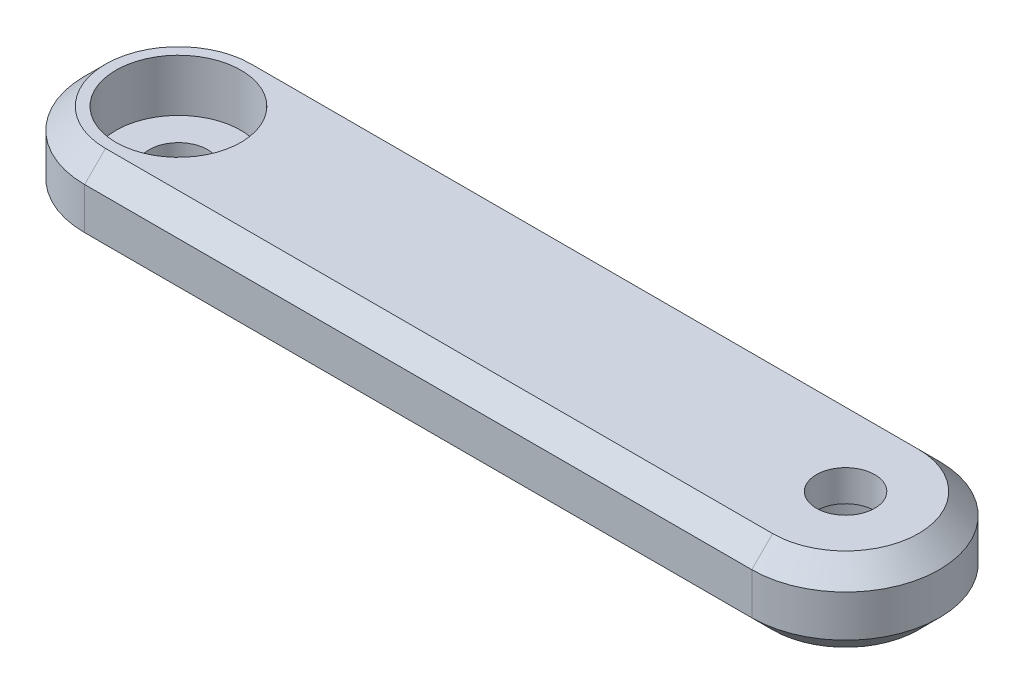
from build123d import *

# Parameters (mm, degrees)
EXTRUDE_1_DEPTH     = 4
SKETCH_2_R          = 1.4
CUT_EXTRUDE_4_DEPTH = 10
CHAMFER_1_SIZE      = 1
SKETCH_5_R          = 2.25
SKETCH_5_R_2        = 1.6
EXTRUDE_2_DEPTH     = 4
SKETCH_7_R          = 3
CUT_EXTRUDE_6_DEPTH = 2.5
SKETCH_8_R          = 3
CUT_EXTRUDE_7_DEPTH = 2.5


with BuildPart() as part:
    # Sketch 1 → Extrude 1 (new body)
    with BuildSketch(Plane(origin=(0, 0, 0), x_dir=(1, 0, 0), z_dir=(0, 1, 0))):
        with BuildLine():
            Line((-15.663286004, 5.805273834), (11.336713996, 5.805273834))
            Line((11.336713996, 5.805273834), (16.336713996, 5.805273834))
            ThreePointArc((16.336713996, 5.805273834), (20.836713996, 1.305273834), (16.336713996, -3.194726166))
            Line((16.336713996, -3.194726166), (11.336713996, -3.194726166))
            Line((11.336713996, -3.194726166), (-15.663286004, -3.194726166))
            ThreePointArc((-15.663286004, -3.194726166), (-20.163286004, 1.305273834), (-15.663286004, 5.805273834))
        make_face()
    extrude(amount=EXTRUDE_1_DEPTH)

    # Sketch 2 → Cut-Extrude 4 (cut)
    with BuildSketch(Plane(origin=(0, 4, 0), x_dir=(1, 0, 0), z_dir=(0, 1, 0))):
        with Locations(Location((-15.663286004, 1.305273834, 0), (0, 0, 270))):
            Circle(SKETCH_2_R)
        with Locations(Location((16.336713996, 1.305273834, 0), (0, 0, 270))):
            Circle(SKETCH_2_R)
    extrude(amount=-CUT_EXTRUDE_4_DEPTH, mode=Mode.SUBTRACT)

    # Chamfer 1
    chamfer_1_edges = [part.edges().sort_by_distance(p)[0] for p in [
        (20.836713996, 4, -1.305273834),
        (0.336713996, 4, -5.805273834),
        (-20.163286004, 4, -1.305273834),
        (0.336713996, 0, -5.805273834),
        (20.836713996, 0, -1.305273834),
        (0.336713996, 0, 3.194726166),
        (-20.163286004, 0, -1.305273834),
        (0.336713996, 4, 3.194726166),
    ]]
    chamfer(chamfer_1_edges, length=CHAMFER_1_SIZE)

    # Sketch 5 → Extrude 2 (add)
    with BuildSketch(Plane.XZ):
        with Locations((16.336713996, -1.305273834)):
            Circle(SKETCH_5_R)
        with Locations((16.336713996, -1.305273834)):
            Circle(SKETCH_5_R_2, mode=Mode.SUBTRACT)
    extrude(amount=-EXTRUDE_2_DEPTH)

    # Sketch 7 → Cut-Extrude 6 (cut)
    with BuildSketch(Plane.XZ):
        with Locations(Location((16.336713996, -1.305273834, 0), (0, 0, 270))):
            Circle(SKETCH_7_R)
    extrude(amount=-CUT_EXTRUDE_6_DEPTH, mode=Mode.SUBTRACT)

    # Sketch 8 → Cut-Extrude 7 (cut)
    with BuildSketch(Plane(origin=(0, 4, 0), x_dir=(1, 0, 0), z_dir=(0, 1, 0))):
        with Locations(Location((-15.663286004, 1.305273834, 0), (0, 0, 270))):
            Circle(SKETCH_8_R)
    extrude(amount=-CUT_EXTRUDE_7_DEPTH, mode=Mode.SUBTRACT)


solid = part.part
